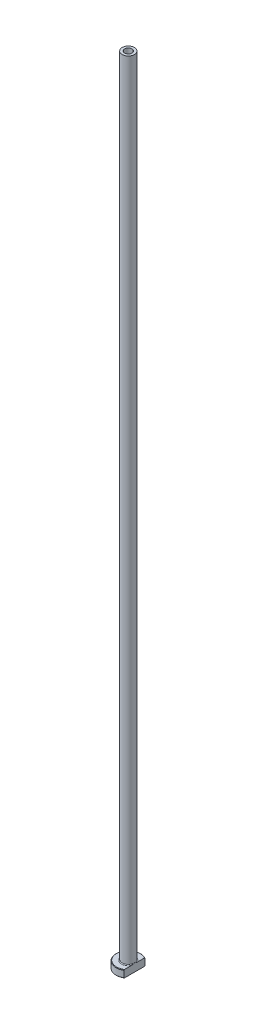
from build123d import *

# Parameters (mm, degrees)
FILLET1_R          = 0.3
CHAMFER1_SIZE      = 0.2
CUT_EXTRUDE1_DEPTH = 326.076913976
CHAMFER2_SIZE      = 0.5


with BuildPart() as part:
    # Sketch1 → Revolve1 (revolve)
    with BuildSketch(Plane.XY, mode=Mode.PRIVATE) as revolve1_sk:
        Polygon((-1.5, 325), (-2.5, 325), (-2.5, 3), (-5, 3), (-5, 0), (-1.75, 0), (-1.75, 268), (-1.5, 280), align=None)
    revolve(revolve1_sk.sketch.rotate(Axis((0, 92.187680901, 0), (0, -1, 0)), 270), axis=Axis((0, 92.187680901, 0), (0, -1, 0)))

    # Fillet1
    fillet1_edges = [part.edges().sort_by_distance(p)[0] for p in [
        (0, 3, -2.5),
    ]]
    fillet(fillet1_edges, radius=FILLET1_R)

    # Chamfer1
    chamfer1_edges = [part.edges().sort_by_distance(p)[0] for p in [
        (0, 0, -5),
        (0, 3, -5),
    ]]
    chamfer(chamfer1_edges, length=CHAMFER1_SIZE)

    # Sketch2 → Cut-Extrude1 (cut, through all)
    with BuildSketch(Plane.XZ):
        with BuildLine():
            Line((2.5, 4.330127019), (2.5, -4.330127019))
            ThreePointArc((2.5, -4.330127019), (5, 0), (2.5, 4.330127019))
        make_face()
    extrude(amount=-CUT_EXTRUDE1_DEPTH, mode=Mode.SUBTRACT)

    # Chamfer2
    chamfer2_edges = [part.edges().sort_by_distance(p)[0] for p in [
        (0, 0, -1.75),
    ]]
    chamfer(chamfer2_edges, length=CHAMFER2_SIZE)


solid = part.part
